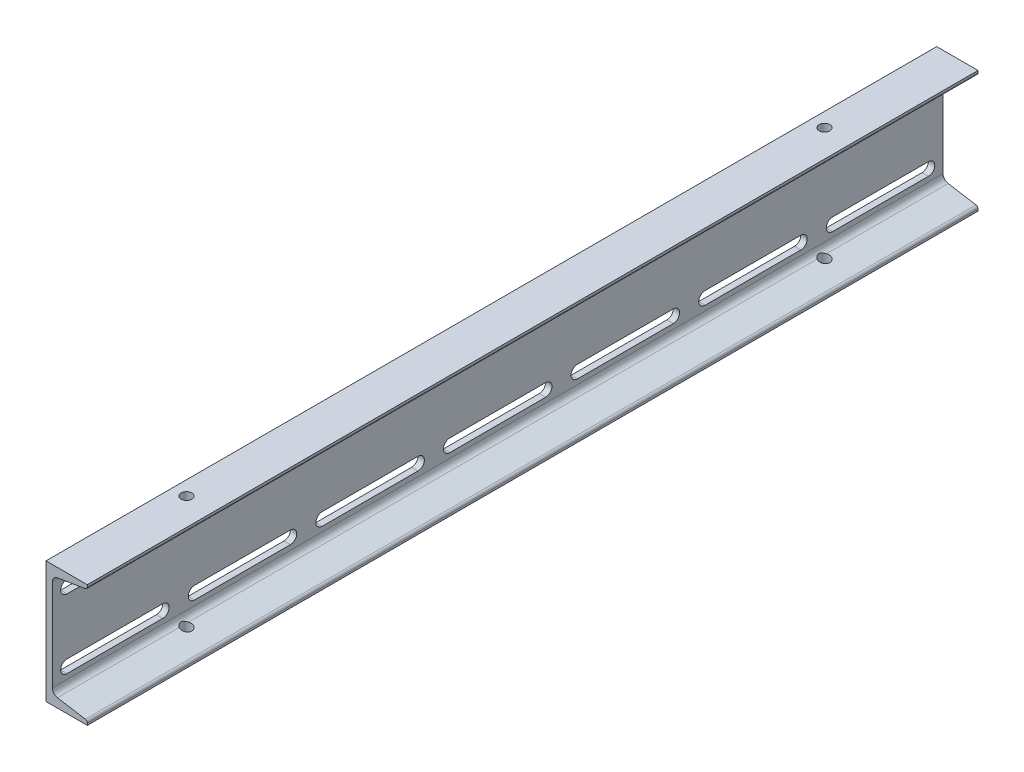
from build123d import *

# Parameters (mm, degrees)
BOSS_EXTRUDE1_DEPTH     = 557.000833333
CUT_EXTRUDE1_DEPTH      = 25.4
CUT_EXTRUDE2_DEPTH      = 564.538650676
CUT_EXTRUDE2_DEPTH_BACK = 564.538650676
SKETCH3_R               = 6.746875


with BuildPart() as part:
    # Sketch1 → Boss-Extrude1 (new, symmetric)
    with BuildSketch(Plane.XY):
        with BuildLine():
            Line((-12.683573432, -76.2), (-12.683573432, 76.2))
            Line((-12.683573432, 76.2), (38.980026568, 76.2))
            Line((38.980026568, 76.2), (38.980026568, 73.710744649))
            ThreePointArc((38.980026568, 73.710744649), (38.257723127, 71.740607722), (36.433150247, 70.704221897))
            Line((36.433150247, 70.704221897), (1.659217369, 64.908143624))
            ThreePointArc((1.659217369, 64.908143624), (-2.902214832, 62.317179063), (-4.707973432, 57.391836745))
            Line((-4.707973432, 57.391836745), (-4.707973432, -57.391836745))
            ThreePointArc((-4.707973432, -57.391836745), (-2.902214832, -62.317179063), (1.659217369, -64.908143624))
            Line((1.659217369, -64.908143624), (36.433150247, -70.704221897))
            ThreePointArc((36.433150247, -70.704221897), (38.257723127, -71.740607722), (38.980026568, -73.710744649))
            Line((38.980026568, -73.710744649), (38.980026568, -76.2))
            Line((38.980026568, -76.2), (-12.683573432, -76.2))
        make_face()
    extrude(amount=BOSS_EXTRUDE1_DEPTH, both=True)

    # Sketch2 → Cut-Extrude1 (cut)
    with BuildSketch(Plane(origin=(-4.707973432, 0, 0), x_dir=(0, 0, -1), z_dir=(1, 0, 0))):
        with BuildLine():
            Line((-538.691666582, 51.1175), (-418.888333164, 51.1175))
            ThreePointArc((-418.888333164, 51.1175), (-410.950833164, 43.18), (-418.888333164, 35.2425))
            Line((-418.888333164, 35.2425), (-538.691666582, 35.2425))
            ThreePointArc((-538.691666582, 35.2425), (-546.629166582, 43.18), (-538.691666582, 51.1175))
        make_face()
        with BuildLine():
            Line((-538.691666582, -35.2425), (-418.888333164, -35.2425))
            ThreePointArc((-418.888333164, -35.2425), (-410.950833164, -43.18), (-418.888333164, -51.1175))
            Line((-418.888333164, -51.1175), (-538.691666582, -51.1175))
            ThreePointArc((-538.691666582, -51.1175), (-546.629166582, -43.18), (-538.691666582, -35.2425))
        make_face()
        with BuildLine():
            Line((-379.095, 51.1175), (-259.291666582, 51.1175))
            ThreePointArc((-259.291666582, 51.1175), (-251.354166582, 43.18), (-259.291666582, 35.2425))
            Line((-259.291666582, 35.2425), (-379.095, 35.2425))
            ThreePointArc((-379.095, 35.2425), (-387.0325, 43.18), (-379.095, 51.1175))
        make_face()
        with BuildLine():
            Line((-379.095, -35.2425), (-259.291666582, -35.2425))
            ThreePointArc((-259.291666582, -35.2425), (-251.354166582, -43.18), (-259.291666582, -51.1175))
            Line((-259.291666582, -51.1175), (-379.095, -51.1175))
            ThreePointArc((-379.095, -51.1175), (-387.0325, -43.18), (-379.095, -35.2425))
        make_face()
        with BuildLine():
            Line((-219.498333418, 51.1175), (-99.695, 51.1175))
            ThreePointArc((-99.695, 51.1175), (-91.7575, 43.18), (-99.695, 35.2425))
            Line((-99.695, 35.2425), (-219.498333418, 35.2425))
            ThreePointArc((-219.498333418, 35.2425), (-227.435833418, 43.18), (-219.498333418, 51.1175))
        make_face()
        with BuildLine():
            Line((-219.498333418, -35.2425), (-99.695, -35.2425))
            ThreePointArc((-99.695, -35.2425), (-91.7575, -43.18), (-99.695, -51.1175))
            Line((-99.695, -51.1175), (-219.498333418, -51.1175))
            ThreePointArc((-219.498333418, -51.1175), (-227.435833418, -43.18), (-219.498333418, -35.2425))
        make_face()
        with BuildLine():
            Line((-59.901666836, 51.1175), (59.901666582, 51.1175))
            ThreePointArc((59.901666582, 51.1175), (67.839166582, 43.18), (59.901666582, 35.2425))
            Line((59.901666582, 35.2425), (-59.901666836, 35.2425))
            ThreePointArc((-59.901666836, 35.2425), (-67.839166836, 43.18), (-59.901666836, 51.1175))
        make_face()
        with BuildLine():
            Line((-59.901666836, -35.2425), (59.901666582, -35.2425))
            ThreePointArc((59.901666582, -35.2425), (67.839166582, -43.18), (59.901666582, -51.1175))
            Line((59.901666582, -51.1175), (-59.901666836, -51.1175))
            ThreePointArc((-59.901666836, -51.1175), (-67.839166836, -43.18), (-59.901666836, -35.2425))
        make_face()
        with BuildLine():
            Line((99.694999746, 51.1175), (219.498333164, 51.1175))
            ThreePointArc((219.498333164, 51.1175), (227.435833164, 43.18), (219.498333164, 35.2425))
            Line((219.498333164, 35.2425), (99.694999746, 35.2425))
            ThreePointArc((99.694999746, 35.2425), (91.757499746, 43.18), (99.694999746, 51.1175))
        make_face()
        with BuildLine():
            Line((99.694999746, -35.2425), (219.498333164, -35.2425))
            ThreePointArc((219.498333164, -35.2425), (227.435833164, -43.18), (219.498333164, -51.1175))
            Line((219.498333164, -51.1175), (99.694999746, -51.1175))
            ThreePointArc((99.694999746, -51.1175), (91.757499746, -43.18), (99.694999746, -35.2425))
        make_face()
        with BuildLine():
            Line((259.291666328, 51.1175), (379.094999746, 51.1175))
            ThreePointArc((379.094999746, 51.1175), (387.032499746, 43.18), (379.094999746, 35.2425))
            Line((379.094999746, 35.2425), (259.291666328, 35.2425))
            ThreePointArc((259.291666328, 35.2425), (251.354166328, 43.18), (259.291666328, 51.1175))
        make_face()
        with BuildLine():
            Line((259.291666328, -35.2425), (379.094999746, -35.2425))
            ThreePointArc((379.094999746, -35.2425), (387.032499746, -43.18), (379.094999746, -51.1175))
            Line((379.094999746, -51.1175), (259.291666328, -51.1175))
            ThreePointArc((259.291666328, -51.1175), (251.354166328, -43.18), (259.291666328, -35.2425))
        make_face()
        with BuildLine():
            Line((418.88833291, 51.1175), (538.691666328, 51.1175))
            ThreePointArc((538.691666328, 51.1175), (546.629166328, 43.18), (538.691666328, 35.2425))
            Line((538.691666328, 35.2425), (418.88833291, 35.2425))
            ThreePointArc((418.88833291, 35.2425), (410.95083291, 43.18), (418.88833291, 51.1175))
        make_face()
        with BuildLine():
            Line((418.88833291, -35.2425), (538.691666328, -35.2425))
            ThreePointArc((538.691666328, -35.2425), (546.629166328, -43.18), (538.691666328, -51.1175))
            Line((538.691666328, -51.1175), (418.88833291, -51.1175))
            ThreePointArc((418.88833291, -51.1175), (410.95083291, -43.18), (418.88833291, -35.2425))
        make_face()
    extrude(amount=-CUT_EXTRUDE1_DEPTH, mode=Mode.SUBTRACT)

    # Sketch3 → Cut-Extrude2 (cut, two sides: drawn at the far end of the back side and taken through both)
    with BuildSketch(Plane(origin=(0, 0, 0), x_dir=(1, 0, 0), z_dir=(0, 1, 0)).offset(-CUT_EXTRUDE2_DEPTH_BACK)):
        with Locations(Location((4.975776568, 398.991666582, 0), (0, 0, 270))):
            Circle(SKETCH3_R)
        with Locations(Location((4.975776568, -398.991666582, 0), (0, 0, 270))):
            Circle(SKETCH3_R)
    extrude(amount=CUT_EXTRUDE2_DEPTH + CUT_EXTRUDE2_DEPTH_BACK, mode=Mode.SUBTRACT)


solid = part.part
